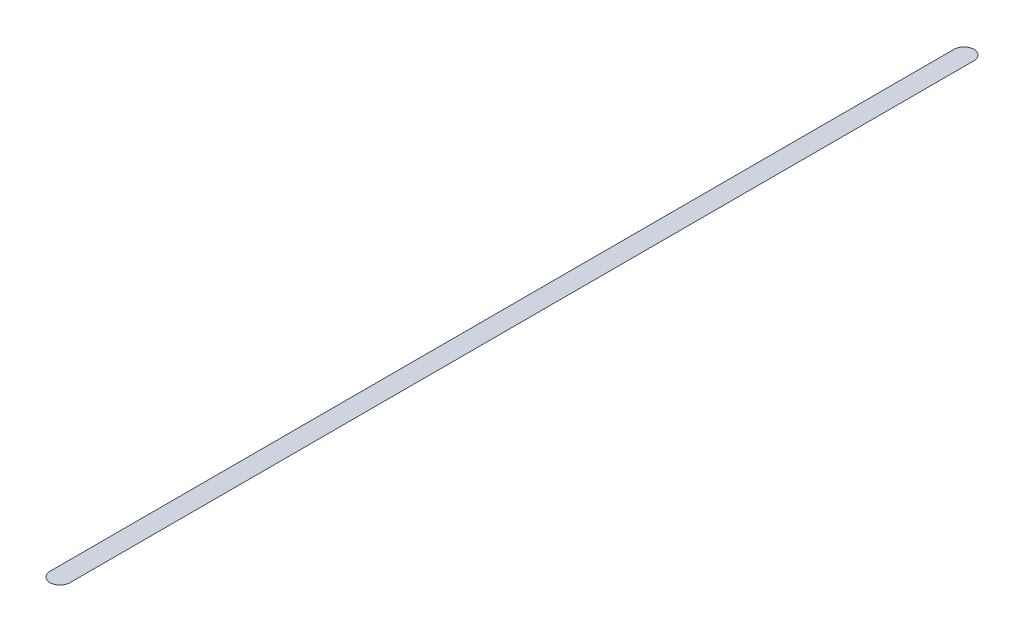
ISO-10303-21;
HEADER;
FILE_DESCRIPTION(('STEP AP214'),'2;1');
FILE_NAME('part.step','',(''),(''),'','','');
FILE_SCHEMA(('AUTOMOTIVE_DESIGN { 1 0 10303 214 1 1 1 1 }'));
ENDSEC;
DATA;
#1=APPLICATION_CONTEXT('core data for automotive mechanical design processes');
#2=APPLICATION_PROTOCOL_DEFINITION('international standard','automotive_design',2000,#1);
#3=PRODUCT_CONTEXT('',#1,'mechanical');
#4=PRODUCT('Part','Part','',(#3));
#5=PRODUCT_RELATED_PRODUCT_CATEGORY('part','',(#4));
#6=PRODUCT_DEFINITION_FORMATION('','',#4);
#7=PRODUCT_DEFINITION_CONTEXT('part definition',#1,'design');
#8=PRODUCT_DEFINITION('design','',#6,#7);
#9=PRODUCT_DEFINITION_SHAPE('','',#8);
#10=(LENGTH_UNIT() NAMED_UNIT(*) SI_UNIT(.MILLI.,.METRE.));
#11=(NAMED_UNIT(*) PLANE_ANGLE_UNIT() SI_UNIT($,.RADIAN.));
#12=(NAMED_UNIT(*) SI_UNIT($,.STERADIAN.) SOLID_ANGLE_UNIT());
#13=UNCERTAINTY_MEASURE_WITH_UNIT(LENGTH_MEASURE(1.E-05),#10,'distance_accuracy_value','');
#14=(GEOMETRIC_REPRESENTATION_CONTEXT(3) GLOBAL_UNCERTAINTY_ASSIGNED_CONTEXT((#13)) GLOBAL_UNIT_ASSIGNED_CONTEXT((#10,
#11,#12)) REPRESENTATION_CONTEXT('',''));
#15=CARTESIAN_POINT('',(0.,0.,0.));
#16=DIRECTION('',(0.,0.,1.));
#17=DIRECTION('',(1.,0.,0.));
#18=AXIS2_PLACEMENT_3D('',#15,#16,#17);
#19=CARTESIAN_POINT('',(0.,-0.581987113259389,90.0239649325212));
#20=DIRECTION('',(0.,0.,-1.));
#21=DIRECTION('',(-1.,0.,0.));
#22=AXIS2_PLACEMENT_3D('',#19,#20,#21);
#23=CYLINDRICAL_SURFACE('',#22,0.634999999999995);
#24=CARTESIAN_POINT('',(0.,-0.581987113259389,-88.265));
#25=DIRECTION('',(0.,0.,1.));
#26=DIRECTION('',(1.,0.,0.));
#27=AXIS2_PLACEMENT_3D('',#24,#25,#26);
#28=CIRCLE('',#27,0.634999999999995);
#29=CARTESIAN_POINT('',(-0.571367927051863,-0.859049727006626,-88.265));
#30=VERTEX_POINT('',#29);
#31=CARTESIAN_POINT('',(0.571367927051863,-0.859049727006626,-88.265));
#32=VERTEX_POINT('',#31);
#33=EDGE_CURVE('E105',#30,#32,#28,.T.);
#34=ORIENTED_EDGE('',*,*,#33,.T.);
#35=DIRECTION('',(0.,0.,-1.));
#36=VECTOR('',#35,1.);
#37=CARTESIAN_POINT('',(0.571367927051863,-0.859049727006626,90.0239649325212));
#38=LINE('',#37,#36);
#39=CARTESIAN_POINT('',(0.571367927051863,-0.859049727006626,88.265));
#40=VERTEX_POINT('',#39);
#41=EDGE_CURVE('E94',#32,#40,#38,.F.);
#42=ORIENTED_EDGE('',*,*,#41,.T.);
#43=CARTESIAN_POINT('',(0.,-0.581987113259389,88.265));
#44=DIRECTION('',(0.,0.,1.));
#45=DIRECTION('',(1.,0.,0.));
#46=AXIS2_PLACEMENT_3D('',#43,#44,#45);
#47=CIRCLE('',#46,0.634999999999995);
#48=CARTESIAN_POINT('',(-0.571367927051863,-0.859049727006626,88.265));
#49=VERTEX_POINT('',#48);
#50=EDGE_CURVE('E113',#49,#40,#47,.T.);
#51=ORIENTED_EDGE('',*,*,#50,.F.);
#52=DIRECTION('',(0.,0.,-1.));
#53=VECTOR('',#52,1.);
#54=CARTESIAN_POINT('',(-0.571367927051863,-0.859049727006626,90.0239649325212));
#55=LINE('',#54,#53);
#56=EDGE_CURVE('E58',#49,#30,#55,.T.);
#57=ORIENTED_EDGE('',*,*,#56,.T.);
#58=EDGE_LOOP('',(#34,#42,#51,#57));
#59=FACE_BOUND('',#58,.T.);
#60=ADVANCED_FACE('F37',(#59),#23,.T.);
#61=CARTESIAN_POINT('',(0.,-0.581987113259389,88.265));
#62=DIRECTION('',(0.,-1.,0.));
#63=DIRECTION('',(1.,0.,0.));
#64=AXIS2_PLACEMENT_3D('',#61,#62,#63);
#65=SPHERICAL_SURFACE('',#64,0.634999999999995);
#66=ORIENTED_EDGE('',*,*,#50,.T.);
#67=CARTESIAN_POINT('',(0.,-0.859049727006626,88.265));
#68=DIRECTION('',(0.,1.,0.));
#69=DIRECTION('',(0.,0.,1.));
#70=AXIS2_PLACEMENT_3D('',#67,#68,#69);
#71=CIRCLE('',#70,0.571367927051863);
#72=EDGE_CURVE('E46',#40,#49,#71,.F.);
#73=ORIENTED_EDGE('',*,*,#72,.T.);
#74=EDGE_LOOP('',(#66,#73));
#75=FACE_BOUND('',#74,.T.);
#76=ADVANCED_FACE('F123',(#75),#65,.T.);
#77=CARTESIAN_POINT('',(0.,-0.581987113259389,-88.265));
#78=DIRECTION('',(0.,1.,0.));
#79=DIRECTION('',(1.,0.,0.));
#80=AXIS2_PLACEMENT_3D('',#77,#78,#79);
#81=SPHERICAL_SURFACE('',#80,0.634999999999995);
#82=ORIENTED_EDGE('',*,*,#33,.F.);
#83=CARTESIAN_POINT('',(0.,-0.859049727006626,-88.265));
#84=DIRECTION('',(0.,1.,0.));
#85=DIRECTION('',(0.,0.,1.));
#86=AXIS2_PLACEMENT_3D('',#83,#84,#85);
#87=CIRCLE('',#86,0.571367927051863);
#88=EDGE_CURVE('E12',#30,#32,#87,.F.);
#89=ORIENTED_EDGE('',*,*,#88,.T.);
#90=EDGE_LOOP('',(#82,#89));
#91=FACE_BOUND('',#90,.T.);
#92=ADVANCED_FACE('F120',(#91),#81,.T.);
#93=CARTESIAN_POINT('',(-1.94265095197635,-1.524,90.0239649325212));
#94=DIRECTION('',(0.,0.,-1.));
#95=DIRECTION('',(-1.,0.,0.));
#96=AXIS2_PLACEMENT_3D('',#93,#94,#95);
#97=CYLINDRICAL_SURFACE('',#96,1.524);
#98=CARTESIAN_POINT('',(-1.94265095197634,-1.524,-88.265));
#99=DIRECTION('',(0.,0.,1.));
#100=DIRECTION('',(1.,0.,0.));
#101=AXIS2_PLACEMENT_3D('',#98,#99,#100);
#102=CIRCLE('',#101,1.524);
#103=CARTESIAN_POINT('',(-1.94265095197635,0.,-88.265));
#104=VERTEX_POINT('',#103);
#105=EDGE_CURVE('E101',#30,#104,#102,.T.);
#106=ORIENTED_EDGE('',*,*,#105,.F.);
#107=ORIENTED_EDGE('',*,*,#56,.F.);
#108=CARTESIAN_POINT('',(-1.94265095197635,-1.524,88.265));
#109=DIRECTION('',(0.,0.,-1.));
#110=DIRECTION('',(-1.,0.,0.));
#111=AXIS2_PLACEMENT_3D('',#108,#109,#110);
#112=CIRCLE('',#111,1.524);
#113=CARTESIAN_POINT('',(-1.94265095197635,0.,88.265));
#114=VERTEX_POINT('',#113);
#115=EDGE_CURVE('E41',#114,#49,#112,.T.);
#116=ORIENTED_EDGE('',*,*,#115,.F.);
#117=DIRECTION('',(0.,0.,-1.));
#118=VECTOR('',#117,1.);
#119=CARTESIAN_POINT('',(-1.94265095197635,0.,101.6));
#120=LINE('',#119,#118);
#121=EDGE_CURVE('E102',#104,#114,#120,.F.);
#122=ORIENTED_EDGE('',*,*,#121,.F.);
#123=EDGE_LOOP('',(#106,#107,#116,#122));
#124=FACE_BOUND('',#123,.T.);
#125=ADVANCED_FACE('F39',(#124),#97,.F.);
#126=CARTESIAN_POINT('',(0.,-1.524,88.265));
#127=DIRECTION('',(0.,-1.,0.));
#128=DIRECTION('',(0.,0.,-1.));
#129=AXIS2_PLACEMENT_3D('',#126,#127,#128);
#130=TOROIDAL_SURFACE('',#129,1.94265095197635,1.524);
#131=ORIENTED_EDGE('',*,*,#115,.T.);
#132=ORIENTED_EDGE('',*,*,#72,.F.);
#133=CARTESIAN_POINT('',(1.94265095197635,-1.524,88.265));
#134=DIRECTION('',(0.,0.,1.));
#135=DIRECTION('',(1.,0.,0.));
#136=AXIS2_PLACEMENT_3D('',#133,#134,#135);
#137=CIRCLE('',#136,1.524);
#138=CARTESIAN_POINT('',(1.94265095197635,0.,88.265));
#139=VERTEX_POINT('',#138);
#140=EDGE_CURVE('E96',#139,#40,#137,.T.);
#141=ORIENTED_EDGE('',*,*,#140,.F.);
#142=CARTESIAN_POINT('',(0.,0.,88.265));
#143=DIRECTION('',(0.,-1.,0.));
#144=DIRECTION('',(0.,0.,-1.));
#145=AXIS2_PLACEMENT_3D('',#142,#143,#144);
#146=CIRCLE('',#145,1.94265095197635);
#147=EDGE_CURVE('E85',#114,#139,#146,.F.);
#148=ORIENTED_EDGE('',*,*,#147,.F.);
#149=EDGE_LOOP('',(#131,#132,#141,#148));
#150=FACE_BOUND('',#149,.T.);
#151=ADVANCED_FACE('F122',(#150),#130,.F.);
#152=CARTESIAN_POINT('',(0.,-1.524,-88.265));
#153=DIRECTION('',(0.,-1.,0.));
#154=DIRECTION('',(0.,0.,-1.));
#155=AXIS2_PLACEMENT_3D('',#152,#153,#154);
#156=TOROIDAL_SURFACE('',#155,1.94265095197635,1.524);
#157=ORIENTED_EDGE('',*,*,#105,.T.);
#158=CARTESIAN_POINT('',(0.,0.,-88.265));
#159=DIRECTION('',(0.,-1.,0.));
#160=DIRECTION('',(0.,0.,-1.));
#161=AXIS2_PLACEMENT_3D('',#158,#159,#160);
#162=CIRCLE('',#161,1.94265095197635);
#163=CARTESIAN_POINT('',(1.94265095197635,0.,-88.265));
#164=VERTEX_POINT('',#163);
#165=EDGE_CURVE('E82',#164,#104,#162,.F.);
#166=ORIENTED_EDGE('',*,*,#165,.F.);
#167=CARTESIAN_POINT('',(1.94265095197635,-1.524,-88.265));
#168=DIRECTION('',(0.,0.,-1.));
#169=DIRECTION('',(-1.,0.,0.));
#170=AXIS2_PLACEMENT_3D('',#167,#168,#169);
#171=CIRCLE('',#170,1.524);
#172=EDGE_CURVE('E91',#32,#164,#171,.T.);
#173=ORIENTED_EDGE('',*,*,#172,.F.);
#174=ORIENTED_EDGE('',*,*,#88,.F.);
#175=EDGE_LOOP('',(#157,#166,#173,#174));
#176=FACE_BOUND('',#175,.T.);
#177=ADVANCED_FACE('F99',(#176),#156,.F.);
#178=CARTESIAN_POINT('',(1.94265095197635,-1.524,90.0239649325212));
#179=DIRECTION('',(0.,0.,-1.));
#180=DIRECTION('',(-1.,0.,0.));
#181=AXIS2_PLACEMENT_3D('',#178,#179,#180);
#182=CYLINDRICAL_SURFACE('',#181,1.524);
#183=ORIENTED_EDGE('',*,*,#140,.T.);
#184=ORIENTED_EDGE('',*,*,#41,.F.);
#185=ORIENTED_EDGE('',*,*,#172,.T.);
#186=DIRECTION('',(0.,0.,-1.));
#187=VECTOR('',#186,1.);
#188=CARTESIAN_POINT('',(1.94265095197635,0.,101.6));
#189=LINE('',#188,#187);
#190=EDGE_CURVE('E78',#139,#164,#189,.T.);
#191=ORIENTED_EDGE('',*,*,#190,.F.);
#192=EDGE_LOOP('',(#183,#184,#185,#191));
#193=FACE_BOUND('',#192,.T.);
#194=ADVANCED_FACE('F92',(#193),#182,.F.);
#195=CARTESIAN_POINT('',(25.,0.,-101.6));
#196=DIRECTION('',(0.,-1.,0.));
#197=DIRECTION('',(0.,0.,-1.));
#198=AXIS2_PLACEMENT_3D('',#195,#196,#197);
#199=PLANE('',#198);
#200=ORIENTED_EDGE('',*,*,#121,.T.);
#201=ORIENTED_EDGE('',*,*,#147,.T.);
#202=ORIENTED_EDGE('',*,*,#190,.T.);
#203=ORIENTED_EDGE('',*,*,#165,.T.);
#204=EDGE_LOOP('',(#200,#201,#202,#203));
#205=FACE_BOUND('',#204,.T.);
#206=ADVANCED_FACE('F80',(#205),#199,.F.);
#207=CLOSED_SHELL('',(#60,#76,#92,#125,#151,#177,#194,#206));
#208=MANIFOLD_SOLID_BREP('B2',#207);
#209=ADVANCED_BREP_SHAPE_REPRESENTATION('',(#18,#208),#14);
#210=SHAPE_DEFINITION_REPRESENTATION(#9,#209);
ENDSEC;
END-ISO-10303-21;
